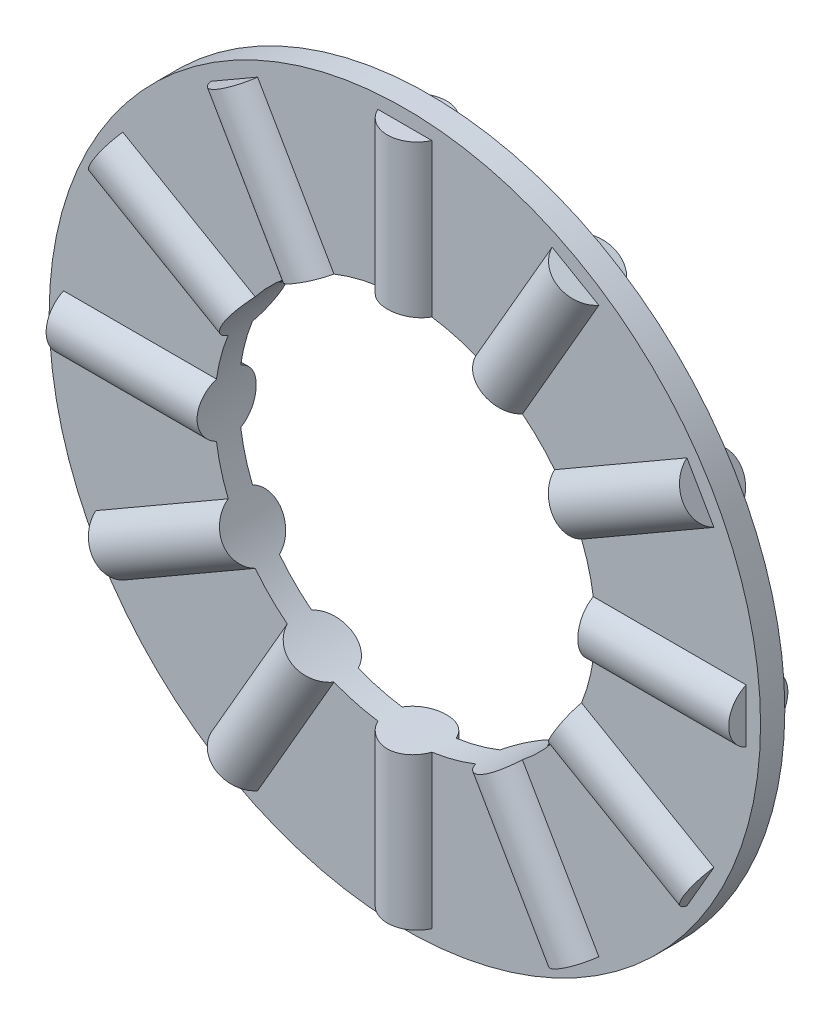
from build123d import *

# Parameters (mm, degrees)
SKETCH1_R          = 11.9126
SKETCH1_R_2        = 6.3754
EXTRUDE1_DEPTH     = 0.8128
SKETCH3_R          = 0.9906
EXTRUDE2_DEPTH     = 11.43
CIRPATTERN1_COUNT  = 6
CIRPATTERN1_ANGLE  = 150
SKETCH5_R          = 6.3754
CUT_EXTRUDE1_DEPTH = 11.43


with BuildPart() as part:
    # Sketch1 → Extrude1 (new body)
    with BuildSketch(Plane.XY):
        Circle(SKETCH1_R)
        Circle(SKETCH1_R_2, mode=Mode.SUBTRACT)
    extrude(amount=EXTRUDE1_DEPTH)

    # Sketch3 → Extrude2 (add, symmetric)
    with BuildSketch(Plane(origin=(0, 0, 0), x_dir=(0, 0, -1), z_dir=(1, 0, 0))):
        with Locations(Location((-0.4064, 0, 0), (0, 0, 245.779056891))):
            Circle(SKETCH3_R)
    extrude2 = extrude(amount=EXTRUDE2_DEPTH, both=True)

    # CirPattern1: Extrude2 ×6 about axis
    cirpattern1_axis = Axis((0, 0, 0), (0, 0, 1))
    for i in range(1, CIRPATTERN1_COUNT):
        add(extrude2.rotate(cirpattern1_axis, i * CIRPATTERN1_ANGLE / (CIRPATTERN1_COUNT - 1)))

    # Sketch5 → Cut-Extrude1 (cut, symmetric)
    with BuildSketch(Plane.XY.offset(0.8128)):
        with Locations(Location((0, 0, 0), (0, 0, 171.853738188))):
            Circle(SKETCH5_R)
    extrude(amount=CUT_EXTRUDE1_DEPTH, both=True, mode=Mode.SUBTRACT)


solid = part.part
